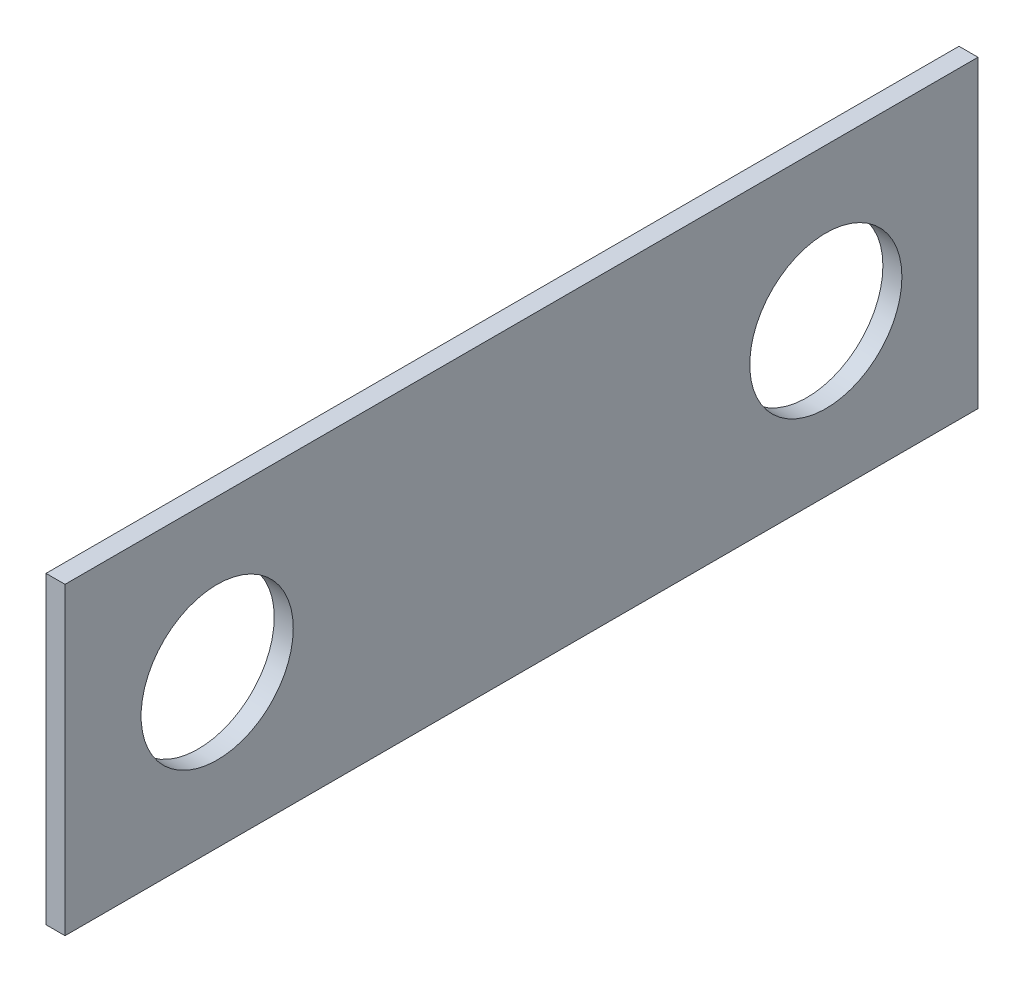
from build123d import *

# Parameters (mm, degrees)
SKETCH1_W           = 38.1
SKETCH1_H           = 12.7
SKETCH1_R           = 3.175
BOSS_EXTRUDE1_DEPTH = 0.79375


with BuildPart() as part:
    # Sketch1 → Boss-Extrude1 (new body)
    with BuildSketch(Plane(origin=(0, 0, 0), x_dir=(0, 0, -1), z_dir=(1, 0, 0))):
        Rectangle(SKETCH1_W, SKETCH1_H)
        with Locations((-12.7, 0)):
            Circle(SKETCH1_R, mode=Mode.SUBTRACT)
        with Locations((12.7, 0)):
            Circle(SKETCH1_R, mode=Mode.SUBTRACT)
    extrude(amount=BOSS_EXTRUDE1_DEPTH)


solid = part.part
